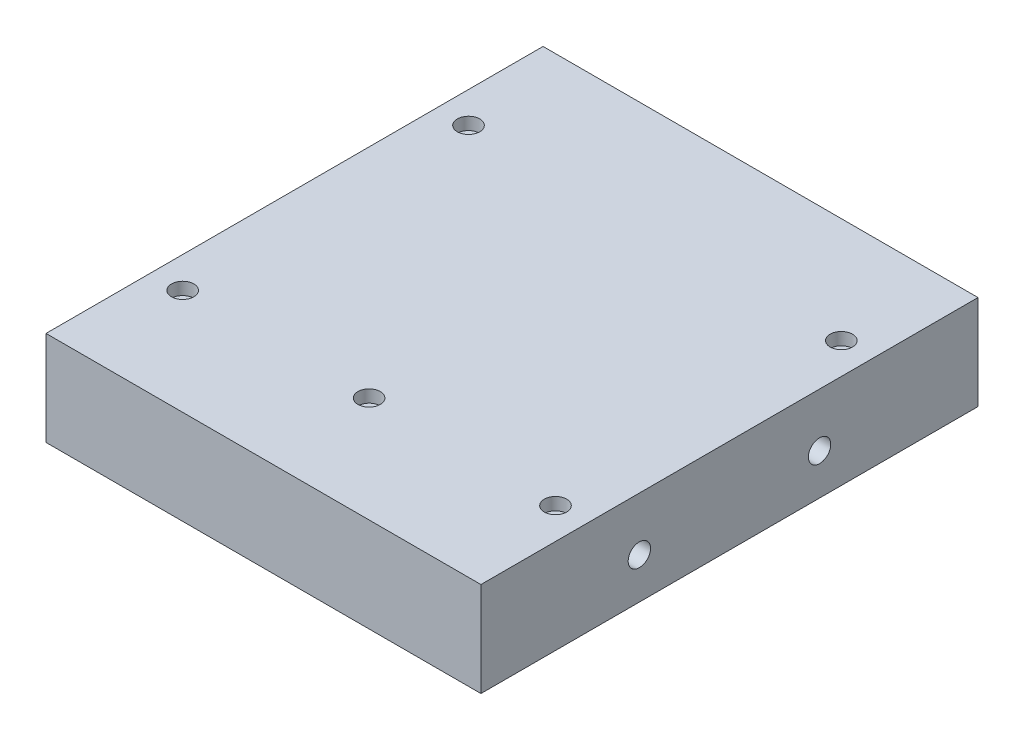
ISO-10303-21;
HEADER;
FILE_DESCRIPTION(('STEP AP214'),'2;1');
FILE_NAME('part.step','',(''),(''),'','','');
FILE_SCHEMA(('AUTOMOTIVE_DESIGN { 1 0 10303 214 1 1 1 1 }'));
ENDSEC;
DATA;
#1=APPLICATION_CONTEXT('core data for automotive mechanical design processes');
#2=APPLICATION_PROTOCOL_DEFINITION('international standard','automotive_design',2000,#1);
#3=PRODUCT_CONTEXT('',#1,'mechanical');
#4=PRODUCT('Part','Part','',(#3));
#5=PRODUCT_RELATED_PRODUCT_CATEGORY('part','',(#4));
#6=PRODUCT_DEFINITION_FORMATION('','',#4);
#7=PRODUCT_DEFINITION_CONTEXT('part definition',#1,'design');
#8=PRODUCT_DEFINITION('design','',#6,#7);
#9=PRODUCT_DEFINITION_SHAPE('','',#8);
#10=(LENGTH_UNIT() NAMED_UNIT(*) SI_UNIT(.MILLI.,.METRE.));
#11=(NAMED_UNIT(*) PLANE_ANGLE_UNIT() SI_UNIT($,.RADIAN.));
#12=(NAMED_UNIT(*) SI_UNIT($,.STERADIAN.) SOLID_ANGLE_UNIT());
#13=UNCERTAINTY_MEASURE_WITH_UNIT(LENGTH_MEASURE(1.E-05),#10,'distance_accuracy_value','');
#14=(GEOMETRIC_REPRESENTATION_CONTEXT(3) GLOBAL_UNCERTAINTY_ASSIGNED_CONTEXT((#13)) GLOBAL_UNIT_ASSIGNED_CONTEXT((#10,
#11,#12)) REPRESENTATION_CONTEXT('',''));
#15=CARTESIAN_POINT('',(0.,0.,0.));
#16=DIRECTION('',(0.,0.,1.));
#17=DIRECTION('',(1.,0.,0.));
#18=AXIS2_PLACEMENT_3D('',#15,#16,#17);
#19=CARTESIAN_POINT('',(22.225,9.652,25.4));
#20=DIRECTION('',(-1.,0.,0.));
#21=DIRECTION('',(0.,0.,1.));
#22=AXIS2_PLACEMENT_3D('',#19,#20,#21);
#23=PLANE('',#22);
#24=CARTESIAN_POINT('',(22.225,4.191,9.2075));
#25=DIRECTION('',(1.,0.,0.));
#26=DIRECTION('',(0.,0.,-1.));
#27=AXIS2_PLACEMENT_3D('',#24,#25,#26);
#28=CIRCLE('',#27,1.143);
#29=CARTESIAN_POINT('',(22.225,4.191,8.0645));
#30=VERTEX_POINT('',#29);
#31=EDGE_CURVE('E157',#30,#30,#28,.T.);
#32=ORIENTED_EDGE('',*,*,#31,.F.);
#33=EDGE_LOOP('',(#32));
#34=FACE_BOUND('',#33,.T.);
#35=CARTESIAN_POINT('',(22.225,4.191,-9.2075));
#36=DIRECTION('',(1.,0.,0.));
#37=DIRECTION('',(0.,0.,-1.));
#38=AXIS2_PLACEMENT_3D('',#35,#36,#37);
#39=CIRCLE('',#38,1.143);
#40=CARTESIAN_POINT('',(22.225,4.191,-10.3505));
#41=VERTEX_POINT('',#40);
#42=EDGE_CURVE('E151',#41,#41,#39,.T.);
#43=ORIENTED_EDGE('',*,*,#42,.F.);
#44=EDGE_LOOP('',(#43));
#45=FACE_BOUND('',#44,.T.);
#46=DIRECTION('',(0.,0.,-1.));
#47=VECTOR('',#46,1.);
#48=CARTESIAN_POINT('',(22.225,0.,25.4));
#49=LINE('',#48,#47);
#50=CARTESIAN_POINT('',(22.225,0.,25.4));
#51=VERTEX_POINT('',#50);
#52=CARTESIAN_POINT('',(22.225,0.,-25.4));
#53=VERTEX_POINT('',#52);
#54=EDGE_CURVE('E95',#51,#53,#49,.T.);
#55=ORIENTED_EDGE('',*,*,#54,.T.);
#56=DIRECTION('',(0.,-1.,0.));
#57=VECTOR('',#56,1.);
#58=CARTESIAN_POINT('',(22.225,9.652,-25.4));
#59=LINE('',#58,#57);
#60=CARTESIAN_POINT('',(22.225,9.652,-25.4));
#61=VERTEX_POINT('',#60);
#62=EDGE_CURVE('E11',#61,#53,#59,.T.);
#63=ORIENTED_EDGE('',*,*,#62,.F.);
#64=DIRECTION('',(0.,0.,-1.));
#65=VECTOR('',#64,1.);
#66=CARTESIAN_POINT('',(22.225,9.652,25.4));
#67=LINE('',#66,#65);
#68=CARTESIAN_POINT('',(22.225,9.652,25.4));
#69=VERTEX_POINT('',#68);
#70=EDGE_CURVE('E83',#69,#61,#67,.T.);
#71=ORIENTED_EDGE('',*,*,#70,.F.);
#72=DIRECTION('',(0.,-1.,0.));
#73=VECTOR('',#72,1.);
#74=CARTESIAN_POINT('',(22.225,9.652,25.4));
#75=LINE('',#74,#73);
#76=EDGE_CURVE('E91',#69,#51,#75,.T.);
#77=ORIENTED_EDGE('',*,*,#76,.T.);
#78=EDGE_LOOP('',(#55,#63,#71,#77));
#79=FACE_BOUND('',#78,.T.);
#80=ADVANCED_FACE('F32',(#34,#45,#79),#23,.F.);
#81=CARTESIAN_POINT('',(-22.225,9.652,-25.4));
#82=DIRECTION('',(0.,0.,1.));
#83=DIRECTION('',(1.,0.,0.));
#84=AXIS2_PLACEMENT_3D('',#81,#82,#83);
#85=PLANE('',#84);
#86=DIRECTION('',(-1.,0.,0.));
#87=VECTOR('',#86,1.);
#88=CARTESIAN_POINT('',(-22.225,0.,-25.4));
#89=LINE('',#88,#87);
#90=CARTESIAN_POINT('',(-22.225,0.,-25.4));
#91=VERTEX_POINT('',#90);
#92=EDGE_CURVE('E87',#53,#91,#89,.T.);
#93=ORIENTED_EDGE('',*,*,#92,.T.);
#94=DIRECTION('',(0.,-1.,0.));
#95=VECTOR('',#94,1.);
#96=CARTESIAN_POINT('',(-22.225,9.652,-25.4));
#97=LINE('',#96,#95);
#98=CARTESIAN_POINT('',(-22.225,9.652,-25.4));
#99=VERTEX_POINT('',#98);
#100=EDGE_CURVE('E40',#99,#91,#97,.T.);
#101=ORIENTED_EDGE('',*,*,#100,.F.);
#102=DIRECTION('',(-1.,0.,0.));
#103=VECTOR('',#102,1.);
#104=CARTESIAN_POINT('',(-22.225,9.652,-25.4));
#105=LINE('',#104,#103);
#106=EDGE_CURVE('E78',#61,#99,#105,.T.);
#107=ORIENTED_EDGE('',*,*,#106,.F.);
#108=ORIENTED_EDGE('',*,*,#62,.T.);
#109=EDGE_LOOP('',(#93,#101,#107,#108));
#110=FACE_BOUND('',#109,.T.);
#111=ADVANCED_FACE('F86',(#110),#85,.F.);
#112=CARTESIAN_POINT('',(-22.225,9.652,25.4));
#113=DIRECTION('',(1.,0.,0.));
#114=DIRECTION('',(0.,0.,-1.));
#115=AXIS2_PLACEMENT_3D('',#112,#113,#114);
#116=PLANE('',#115);
#117=CARTESIAN_POINT('',(-22.225,4.191,-9.2075));
#118=DIRECTION('',(-1.,0.,0.));
#119=DIRECTION('',(0.,0.,1.));
#120=AXIS2_PLACEMENT_3D('',#117,#118,#119);
#121=CIRCLE('',#120,1.143);
#122=CARTESIAN_POINT('',(-22.225,4.191,-8.0645));
#123=VERTEX_POINT('',#122);
#124=EDGE_CURVE('E146',#123,#123,#121,.T.);
#125=ORIENTED_EDGE('',*,*,#124,.F.);
#126=EDGE_LOOP('',(#125));
#127=FACE_BOUND('',#126,.T.);
#128=CARTESIAN_POINT('',(-22.225,4.191,9.2075));
#129=DIRECTION('',(-1.,0.,0.));
#130=DIRECTION('',(0.,0.,1.));
#131=AXIS2_PLACEMENT_3D('',#128,#129,#130);
#132=CIRCLE('',#131,1.143);
#133=CARTESIAN_POINT('',(-22.225,4.191,10.3505));
#134=VERTEX_POINT('',#133);
#135=EDGE_CURVE('E139',#134,#134,#132,.T.);
#136=ORIENTED_EDGE('',*,*,#135,.F.);
#137=EDGE_LOOP('',(#136));
#138=FACE_BOUND('',#137,.T.);
#139=DIRECTION('',(0.,0.,1.));
#140=VECTOR('',#139,1.);
#141=CARTESIAN_POINT('',(-22.225,0.,25.4));
#142=LINE('',#141,#140);
#143=CARTESIAN_POINT('',(-22.225,0.,25.4));
#144=VERTEX_POINT('',#143);
#145=EDGE_CURVE('E65',#91,#144,#142,.T.);
#146=ORIENTED_EDGE('',*,*,#145,.T.);
#147=DIRECTION('',(0.,-1.,0.));
#148=VECTOR('',#147,1.);
#149=CARTESIAN_POINT('',(-22.225,9.652,25.4));
#150=LINE('',#149,#148);
#151=CARTESIAN_POINT('',(-22.225,9.652,25.4));
#152=VERTEX_POINT('',#151);
#153=EDGE_CURVE('E88',#152,#144,#150,.T.);
#154=ORIENTED_EDGE('',*,*,#153,.F.);
#155=DIRECTION('',(0.,0.,1.));
#156=VECTOR('',#155,1.);
#157=CARTESIAN_POINT('',(-22.225,9.652,25.4));
#158=LINE('',#157,#156);
#159=EDGE_CURVE('E81',#99,#152,#158,.T.);
#160=ORIENTED_EDGE('',*,*,#159,.F.);
#161=ORIENTED_EDGE('',*,*,#100,.T.);
#162=EDGE_LOOP('',(#146,#154,#160,#161));
#163=FACE_BOUND('',#162,.T.);
#164=ADVANCED_FACE('F89',(#127,#138,#163),#116,.F.);
#165=CARTESIAN_POINT('',(-22.225,9.652,25.4));
#166=DIRECTION('',(0.,0.,-1.));
#167=DIRECTION('',(-1.,0.,0.));
#168=AXIS2_PLACEMENT_3D('',#165,#166,#167);
#169=PLANE('',#168);
#170=DIRECTION('',(1.,0.,0.));
#171=VECTOR('',#170,1.);
#172=CARTESIAN_POINT('',(-22.225,0.,25.4));
#173=LINE('',#172,#171);
#174=EDGE_CURVE('E71',#144,#51,#173,.T.);
#175=ORIENTED_EDGE('',*,*,#174,.T.);
#176=ORIENTED_EDGE('',*,*,#76,.F.);
#177=DIRECTION('',(1.,0.,0.));
#178=VECTOR('',#177,1.);
#179=CARTESIAN_POINT('',(-22.225,9.652,25.4));
#180=LINE('',#179,#178);
#181=EDGE_CURVE('E48',#152,#69,#180,.T.);
#182=ORIENTED_EDGE('',*,*,#181,.F.);
#183=ORIENTED_EDGE('',*,*,#153,.T.);
#184=EDGE_LOOP('',(#175,#176,#182,#183));
#185=FACE_BOUND('',#184,.T.);
#186=ADVANCED_FACE('F103',(#185),#169,.F.);
#187=CARTESIAN_POINT('',(0.,9.652,0.));
#188=DIRECTION('',(0.,-1.,0.));
#189=DIRECTION('',(0.,0.,-1.));
#190=AXIS2_PLACEMENT_3D('',#187,#188,#189);
#191=PLANE('',#190);
#192=CARTESIAN_POINT('',(19.05,9.652,-14.605));
#193=DIRECTION('',(0.,1.,0.));
#194=DIRECTION('',(0.,0.,1.));
#195=AXIS2_PLACEMENT_3D('',#192,#193,#194);
#196=CIRCLE('',#195,1.143);
#197=CARTESIAN_POINT('',(19.05,9.652,-13.462));
#198=VERTEX_POINT('',#197);
#199=EDGE_CURVE('E115',#198,#198,#196,.T.);
#200=ORIENTED_EDGE('',*,*,#199,.F.);
#201=EDGE_LOOP('',(#200));
#202=FACE_BOUND('',#201,.T.);
#203=CARTESIAN_POINT('',(-19.05,9.652,-14.605));
#204=DIRECTION('',(0.,1.,0.));
#205=DIRECTION('',(0.,0.,1.));
#206=AXIS2_PLACEMENT_3D('',#203,#204,#205);
#207=CIRCLE('',#206,1.143);
#208=CARTESIAN_POINT('',(-19.05,9.652,-13.462));
#209=VERTEX_POINT('',#208);
#210=EDGE_CURVE('E122',#209,#209,#207,.T.);
#211=ORIENTED_EDGE('',*,*,#210,.F.);
#212=EDGE_LOOP('',(#211));
#213=FACE_BOUND('',#212,.T.);
#214=CARTESIAN_POINT('',(19.05,9.652,14.605));
#215=DIRECTION('',(0.,1.,0.));
#216=DIRECTION('',(0.,0.,1.));
#217=AXIS2_PLACEMENT_3D('',#214,#215,#216);
#218=CIRCLE('',#217,1.143);
#219=CARTESIAN_POINT('',(19.05,9.652,15.748));
#220=VERTEX_POINT('',#219);
#221=EDGE_CURVE('E128',#220,#220,#218,.T.);
#222=ORIENTED_EDGE('',*,*,#221,.F.);
#223=EDGE_LOOP('',(#222));
#224=FACE_BOUND('',#223,.T.);
#225=CARTESIAN_POINT('',(-19.05,9.652,14.605));
#226=DIRECTION('',(0.,1.,0.));
#227=DIRECTION('',(0.,0.,1.));
#228=AXIS2_PLACEMENT_3D('',#225,#226,#227);
#229=CIRCLE('',#228,1.143);
#230=CARTESIAN_POINT('',(-19.05,9.652,15.748));
#231=VERTEX_POINT('',#230);
#232=EDGE_CURVE('E134',#231,#231,#229,.T.);
#233=ORIENTED_EDGE('',*,*,#232,.F.);
#234=EDGE_LOOP('',(#233));
#235=FACE_BOUND('',#234,.T.);
#236=CARTESIAN_POINT('',(0.,9.652,14.605));
#237=DIRECTION('',(0.,1.,0.));
#238=DIRECTION('',(0.,0.,1.));
#239=AXIS2_PLACEMENT_3D('',#236,#237,#238);
#240=CIRCLE('',#239,1.143);
#241=CARTESIAN_POINT('',(0.,9.652,15.748));
#242=VERTEX_POINT('',#241);
#243=EDGE_CURVE('E109',#242,#242,#240,.T.);
#244=ORIENTED_EDGE('',*,*,#243,.F.);
#245=EDGE_LOOP('',(#244));
#246=FACE_BOUND('',#245,.T.);
#247=ORIENTED_EDGE('',*,*,#70,.T.);
#248=ORIENTED_EDGE('',*,*,#106,.T.);
#249=ORIENTED_EDGE('',*,*,#159,.T.);
#250=ORIENTED_EDGE('',*,*,#181,.T.);
#251=EDGE_LOOP('',(#247,#248,#249,#250));
#252=FACE_BOUND('',#251,.T.);
#253=ADVANCED_FACE('F79',(#202,#213,#224,#235,#246,#252),#191,.F.);
#254=CARTESIAN_POINT('',(0.,0.,0.));
#255=DIRECTION('',(0.,-1.,0.));
#256=DIRECTION('',(0.,0.,-1.));
#257=AXIS2_PLACEMENT_3D('',#254,#255,#256);
#258=PLANE('',#257);
#259=ORIENTED_EDGE('',*,*,#54,.F.);
#260=ORIENTED_EDGE('',*,*,#174,.F.);
#261=ORIENTED_EDGE('',*,*,#145,.F.);
#262=ORIENTED_EDGE('',*,*,#92,.F.);
#263=EDGE_LOOP('',(#259,#260,#261,#262));
#264=FACE_BOUND('',#263,.T.);
#265=ADVANCED_FACE('F106',(#264),#258,.T.);
#266=CARTESIAN_POINT('',(0.,8.382,14.605));
#267=DIRECTION('',(0.,1.,0.));
#268=DIRECTION('',(0.,0.,1.));
#269=AXIS2_PLACEMENT_3D('',#266,#267,#268);
#270=CYLINDRICAL_SURFACE('',#269,1.143);
#271=CARTESIAN_POINT('',(0.,8.382,14.605));
#272=DIRECTION('',(0.,1.,0.));
#273=DIRECTION('',(0.,0.,1.));
#274=AXIS2_PLACEMENT_3D('',#271,#272,#273);
#275=CIRCLE('',#274,1.143);
#276=CARTESIAN_POINT('',(0.,8.382,15.748));
#277=VERTEX_POINT('',#276);
#278=EDGE_CURVE('E98',#277,#277,#275,.T.);
#279=ORIENTED_EDGE('',*,*,#278,.F.);
#280=EDGE_LOOP('',(#279));
#281=FACE_BOUND('',#280,.T.);
#282=ORIENTED_EDGE('',*,*,#243,.T.);
#283=EDGE_LOOP('',(#282));
#284=FACE_BOUND('',#283,.T.);
#285=ADVANCED_FACE('F238',(#281,#284),#270,.F.);
#286=CARTESIAN_POINT('',(0.,8.382,14.605));
#287=DIRECTION('',(0.,1.,0.));
#288=DIRECTION('',(0.,0.,1.));
#289=AXIS2_PLACEMENT_3D('',#286,#287,#288);
#290=PLANE('',#289);
#291=ORIENTED_EDGE('',*,*,#278,.T.);
#292=EDGE_LOOP('',(#291));
#293=FACE_BOUND('',#292,.T.);
#294=ADVANCED_FACE('F212',(#293),#290,.T.);
#295=CARTESIAN_POINT('',(-19.05,8.382,14.605));
#296=DIRECTION('',(0.,1.,0.));
#297=DIRECTION('',(0.,0.,1.));
#298=AXIS2_PLACEMENT_3D('',#295,#296,#297);
#299=CYLINDRICAL_SURFACE('',#298,1.143);
#300=CARTESIAN_POINT('',(-19.05,8.382,14.605));
#301=DIRECTION('',(0.,1.,0.));
#302=DIRECTION('',(0.,0.,1.));
#303=AXIS2_PLACEMENT_3D('',#300,#301,#302);
#304=CIRCLE('',#303,1.143);
#305=CARTESIAN_POINT('',(-19.05,8.382,15.748));
#306=VERTEX_POINT('',#305);
#307=EDGE_CURVE('E112',#306,#306,#304,.T.);
#308=ORIENTED_EDGE('',*,*,#307,.F.);
#309=EDGE_LOOP('',(#308));
#310=FACE_BOUND('',#309,.T.);
#311=ORIENTED_EDGE('',*,*,#232,.T.);
#312=EDGE_LOOP('',(#311));
#313=FACE_BOUND('',#312,.T.);
#314=ADVANCED_FACE('F208',(#310,#313),#299,.F.);
#315=CARTESIAN_POINT('',(-19.05,8.382,14.605));
#316=DIRECTION('',(0.,1.,0.));
#317=DIRECTION('',(0.,0.,1.));
#318=AXIS2_PLACEMENT_3D('',#315,#316,#317);
#319=PLANE('',#318);
#320=ORIENTED_EDGE('',*,*,#307,.T.);
#321=EDGE_LOOP('',(#320));
#322=FACE_BOUND('',#321,.T.);
#323=ADVANCED_FACE('F204',(#322),#319,.T.);
#324=CARTESIAN_POINT('',(19.05,8.382,14.605));
#325=DIRECTION('',(0.,1.,0.));
#326=DIRECTION('',(0.,0.,1.));
#327=AXIS2_PLACEMENT_3D('',#324,#325,#326);
#328=CYLINDRICAL_SURFACE('',#327,1.143);
#329=CARTESIAN_POINT('',(19.05,8.382,14.605));
#330=DIRECTION('',(0.,1.,0.));
#331=DIRECTION('',(0.,0.,1.));
#332=AXIS2_PLACEMENT_3D('',#329,#330,#331);
#333=CIRCLE('',#332,1.143);
#334=CARTESIAN_POINT('',(19.05,8.382,15.748));
#335=VERTEX_POINT('',#334);
#336=EDGE_CURVE('E131',#335,#335,#333,.T.);
#337=ORIENTED_EDGE('',*,*,#336,.F.);
#338=EDGE_LOOP('',(#337));
#339=FACE_BOUND('',#338,.T.);
#340=ORIENTED_EDGE('',*,*,#221,.T.);
#341=EDGE_LOOP('',(#340));
#342=FACE_BOUND('',#341,.T.);
#343=ADVANCED_FACE('F207',(#339,#342),#328,.F.);
#344=CARTESIAN_POINT('',(19.05,8.382,14.605));
#345=DIRECTION('',(0.,1.,0.));
#346=DIRECTION('',(0.,0.,1.));
#347=AXIS2_PLACEMENT_3D('',#344,#345,#346);
#348=PLANE('',#347);
#349=ORIENTED_EDGE('',*,*,#336,.T.);
#350=EDGE_LOOP('',(#349));
#351=FACE_BOUND('',#350,.T.);
#352=ADVANCED_FACE('F214',(#351),#348,.T.);
#353=CARTESIAN_POINT('',(-19.05,8.382,-14.605));
#354=DIRECTION('',(0.,1.,0.));
#355=DIRECTION('',(0.,0.,1.));
#356=AXIS2_PLACEMENT_3D('',#353,#354,#355);
#357=CYLINDRICAL_SURFACE('',#356,1.143);
#358=CARTESIAN_POINT('',(-19.05,8.382,-14.605));
#359=DIRECTION('',(0.,1.,0.));
#360=DIRECTION('',(0.,0.,1.));
#361=AXIS2_PLACEMENT_3D('',#358,#359,#360);
#362=CIRCLE('',#361,1.143);
#363=CARTESIAN_POINT('',(-19.05,8.382,-13.462));
#364=VERTEX_POINT('',#363);
#365=EDGE_CURVE('E125',#364,#364,#362,.T.);
#366=ORIENTED_EDGE('',*,*,#365,.F.);
#367=EDGE_LOOP('',(#366));
#368=FACE_BOUND('',#367,.T.);
#369=ORIENTED_EDGE('',*,*,#210,.T.);
#370=EDGE_LOOP('',(#369));
#371=FACE_BOUND('',#370,.T.);
#372=ADVANCED_FACE('F217',(#368,#371),#357,.F.);
#373=CARTESIAN_POINT('',(-19.05,8.382,-14.605));
#374=DIRECTION('',(0.,1.,0.));
#375=DIRECTION('',(0.,0.,1.));
#376=AXIS2_PLACEMENT_3D('',#373,#374,#375);
#377=PLANE('',#376);
#378=ORIENTED_EDGE('',*,*,#365,.T.);
#379=EDGE_LOOP('',(#378));
#380=FACE_BOUND('',#379,.T.);
#381=ADVANCED_FACE('F222',(#380),#377,.T.);
#382=CARTESIAN_POINT('',(19.05,8.382,-14.605));
#383=DIRECTION('',(0.,1.,0.));
#384=DIRECTION('',(0.,0.,1.));
#385=AXIS2_PLACEMENT_3D('',#382,#383,#384);
#386=CYLINDRICAL_SURFACE('',#385,1.143);
#387=CARTESIAN_POINT('',(19.05,8.382,-14.605));
#388=DIRECTION('',(0.,1.,0.));
#389=DIRECTION('',(0.,0.,1.));
#390=AXIS2_PLACEMENT_3D('',#387,#388,#389);
#391=CIRCLE('',#390,1.143);
#392=CARTESIAN_POINT('',(19.05,8.382,-13.462));
#393=VERTEX_POINT('',#392);
#394=EDGE_CURVE('E118',#393,#393,#391,.T.);
#395=ORIENTED_EDGE('',*,*,#394,.F.);
#396=EDGE_LOOP('',(#395));
#397=FACE_BOUND('',#396,.T.);
#398=ORIENTED_EDGE('',*,*,#199,.T.);
#399=EDGE_LOOP('',(#398));
#400=FACE_BOUND('',#399,.T.);
#401=ADVANCED_FACE('F225',(#397,#400),#386,.F.);
#402=CARTESIAN_POINT('',(19.05,8.382,-14.605));
#403=DIRECTION('',(0.,1.,0.));
#404=DIRECTION('',(0.,0.,1.));
#405=AXIS2_PLACEMENT_3D('',#402,#403,#404);
#406=PLANE('',#405);
#407=ORIENTED_EDGE('',*,*,#394,.T.);
#408=EDGE_LOOP('',(#407));
#409=FACE_BOUND('',#408,.T.);
#410=ADVANCED_FACE('F202',(#409),#406,.T.);
#411=CARTESIAN_POINT('',(-12.065,4.191,9.2075));
#412=DIRECTION('',(-1.,0.,0.));
#413=DIRECTION('',(0.,0.,1.));
#414=AXIS2_PLACEMENT_3D('',#411,#412,#413);
#415=CYLINDRICAL_SURFACE('',#414,1.143);
#416=CARTESIAN_POINT('',(-12.065,4.191,9.2075));
#417=DIRECTION('',(-1.,0.,0.));
#418=DIRECTION('',(0.,0.,1.));
#419=AXIS2_PLACEMENT_3D('',#416,#417,#418);
#420=CIRCLE('',#419,1.143);
#421=CARTESIAN_POINT('',(-12.065,4.191,10.3505));
#422=VERTEX_POINT('',#421);
#423=EDGE_CURVE('E142',#422,#422,#420,.T.);
#424=ORIENTED_EDGE('',*,*,#423,.F.);
#425=EDGE_LOOP('',(#424));
#426=FACE_BOUND('',#425,.T.);
#427=ORIENTED_EDGE('',*,*,#135,.T.);
#428=EDGE_LOOP('',(#427));
#429=FACE_BOUND('',#428,.T.);
#430=ADVANCED_FACE('F198',(#426,#429),#415,.F.);
#431=CARTESIAN_POINT('',(-12.065,4.191,9.2075));
#432=DIRECTION('',(-1.,0.,0.));
#433=DIRECTION('',(0.,0.,1.));
#434=AXIS2_PLACEMENT_3D('',#431,#432,#433);
#435=PLANE('',#434);
#436=ORIENTED_EDGE('',*,*,#423,.T.);
#437=EDGE_LOOP('',(#436));
#438=FACE_BOUND('',#437,.T.);
#439=ADVANCED_FACE('F194',(#438),#435,.T.);
#440=CARTESIAN_POINT('',(-12.065,4.191,-9.2075));
#441=DIRECTION('',(-1.,0.,0.));
#442=DIRECTION('',(0.,0.,1.));
#443=AXIS2_PLACEMENT_3D('',#440,#441,#442);
#444=CYLINDRICAL_SURFACE('',#443,1.143);
#445=CARTESIAN_POINT('',(-12.065,4.191,-9.2075));
#446=DIRECTION('',(-1.,0.,0.));
#447=DIRECTION('',(0.,0.,1.));
#448=AXIS2_PLACEMENT_3D('',#445,#446,#447);
#449=CIRCLE('',#448,1.143);
#450=CARTESIAN_POINT('',(-12.065,4.191,-8.0645));
#451=VERTEX_POINT('',#450);
#452=EDGE_CURVE('E119',#451,#451,#449,.T.);
#453=ORIENTED_EDGE('',*,*,#452,.F.);
#454=EDGE_LOOP('',(#453));
#455=FACE_BOUND('',#454,.T.);
#456=ORIENTED_EDGE('',*,*,#124,.T.);
#457=EDGE_LOOP('',(#456));
#458=FACE_BOUND('',#457,.T.);
#459=ADVANCED_FACE('F187',(#455,#458),#444,.F.);
#460=CARTESIAN_POINT('',(-12.065,4.191,-9.2075));
#461=DIRECTION('',(-1.,0.,0.));
#462=DIRECTION('',(0.,0.,1.));
#463=AXIS2_PLACEMENT_3D('',#460,#461,#462);
#464=PLANE('',#463);
#465=ORIENTED_EDGE('',*,*,#452,.T.);
#466=EDGE_LOOP('',(#465));
#467=FACE_BOUND('',#466,.T.);
#468=ADVANCED_FACE('F178',(#467),#464,.T.);
#469=CARTESIAN_POINT('',(12.065,4.191,-9.2075));
#470=DIRECTION('',(1.,0.,0.));
#471=DIRECTION('',(0.,0.,-1.));
#472=AXIS2_PLACEMENT_3D('',#469,#470,#471);
#473=CYLINDRICAL_SURFACE('',#472,1.143);
#474=CARTESIAN_POINT('',(12.065,4.191,-9.2075));
#475=DIRECTION('',(1.,0.,0.));
#476=DIRECTION('',(0.,0.,-1.));
#477=AXIS2_PLACEMENT_3D('',#474,#475,#476);
#478=CIRCLE('',#477,1.143);
#479=CARTESIAN_POINT('',(12.065,4.191,-10.3505));
#480=VERTEX_POINT('',#479);
#481=EDGE_CURVE('E154',#480,#480,#478,.T.);
#482=ORIENTED_EDGE('',*,*,#481,.F.);
#483=EDGE_LOOP('',(#482));
#484=FACE_BOUND('',#483,.T.);
#485=ORIENTED_EDGE('',*,*,#42,.T.);
#486=EDGE_LOOP('',(#485));
#487=FACE_BOUND('',#486,.T.);
#488=ADVANCED_FACE('F176',(#484,#487),#473,.F.);
#489=CARTESIAN_POINT('',(12.065,4.191,-9.2075));
#490=DIRECTION('',(1.,0.,0.));
#491=DIRECTION('',(0.,0.,-1.));
#492=AXIS2_PLACEMENT_3D('',#489,#490,#491);
#493=PLANE('',#492);
#494=ORIENTED_EDGE('',*,*,#481,.T.);
#495=EDGE_LOOP('',(#494));
#496=FACE_BOUND('',#495,.T.);
#497=ADVANCED_FACE('F168',(#496),#493,.T.);
#498=CARTESIAN_POINT('',(12.065,4.191,9.2075));
#499=DIRECTION('',(1.,0.,0.));
#500=DIRECTION('',(0.,0.,-1.));
#501=AXIS2_PLACEMENT_3D('',#498,#499,#500);
#502=CYLINDRICAL_SURFACE('',#501,1.143);
#503=CARTESIAN_POINT('',(12.065,4.191,9.2075));
#504=DIRECTION('',(1.,0.,0.));
#505=DIRECTION('',(0.,0.,-1.));
#506=AXIS2_PLACEMENT_3D('',#503,#504,#505);
#507=CIRCLE('',#506,1.143);
#508=CARTESIAN_POINT('',(12.065,4.191,8.0645));
#509=VERTEX_POINT('',#508);
#510=EDGE_CURVE('E143',#509,#509,#507,.T.);
#511=ORIENTED_EDGE('',*,*,#510,.F.);
#512=EDGE_LOOP('',(#511));
#513=FACE_BOUND('',#512,.T.);
#514=ORIENTED_EDGE('',*,*,#31,.T.);
#515=EDGE_LOOP('',(#514));
#516=FACE_BOUND('',#515,.T.);
#517=ADVANCED_FACE('F165',(#513,#516),#502,.F.);
#518=CARTESIAN_POINT('',(12.065,4.191,9.2075));
#519=DIRECTION('',(1.,0.,0.));
#520=DIRECTION('',(0.,0.,-1.));
#521=AXIS2_PLACEMENT_3D('',#518,#519,#520);
#522=PLANE('',#521);
#523=ORIENTED_EDGE('',*,*,#510,.T.);
#524=EDGE_LOOP('',(#523));
#525=FACE_BOUND('',#524,.T.);
#526=ADVANCED_FACE('F163',(#525),#522,.T.);
#527=CLOSED_SHELL('',(#80,#111,#164,#186,#253,#265,#285,#294,#314,#323,#343,#352,#372,#381,#401,
#410,#430,#439,#459,#468,#488,#497,#517,#526));
#528=MANIFOLD_SOLID_BREP('B2',#527);
#529=ADVANCED_BREP_SHAPE_REPRESENTATION('',(#18,#528),#14);
#530=SHAPE_DEFINITION_REPRESENTATION(#9,#529);
ENDSEC;
END-ISO-10303-21;
